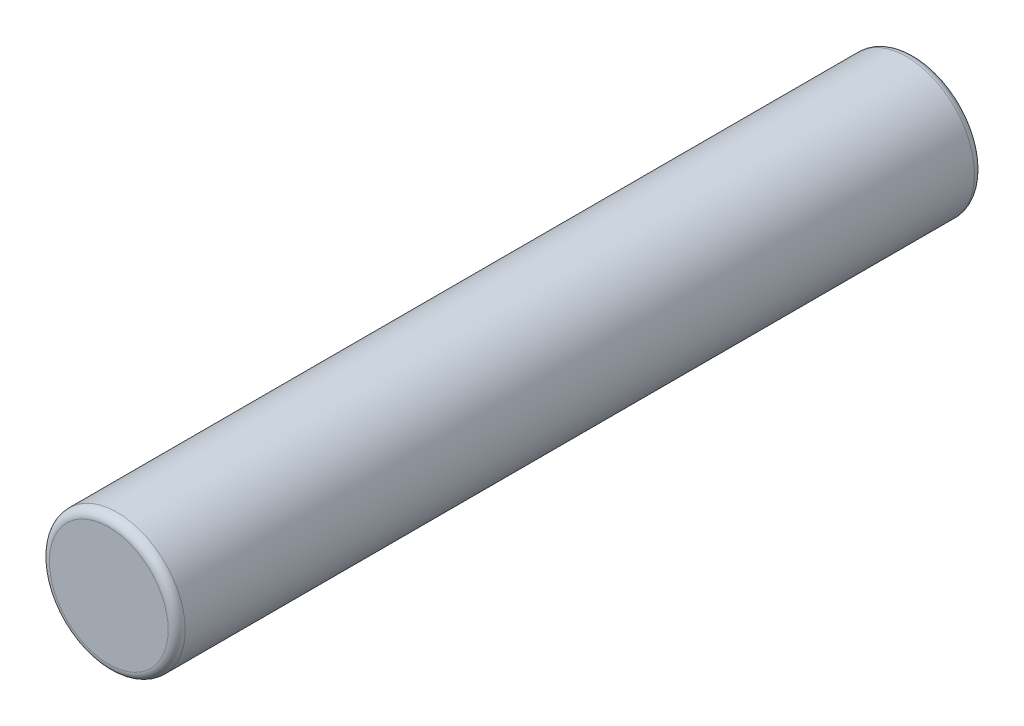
from build123d import *

# Parameters (mm, degrees)
SKETCH_1_R      = 0.8
EXTRUDE_1_DEPTH = 9.5
FILLET_1_R      = 0.1


with BuildPart() as part:
    # Sketch 1 → Extrude 1 (new body)
    with BuildSketch(Plane.XY):
        Circle(SKETCH_1_R)
    extrude(amount=EXTRUDE_1_DEPTH)

    # Fillet 1
    fillet_1_edges = [part.edges().sort_by_distance(p)[0] for p in [
        (-0.8, 0, 0),
        (-0.8, 0, 9.5),
    ]]
    fillet(fillet_1_edges, radius=FILLET_1_R)


solid = part.part
